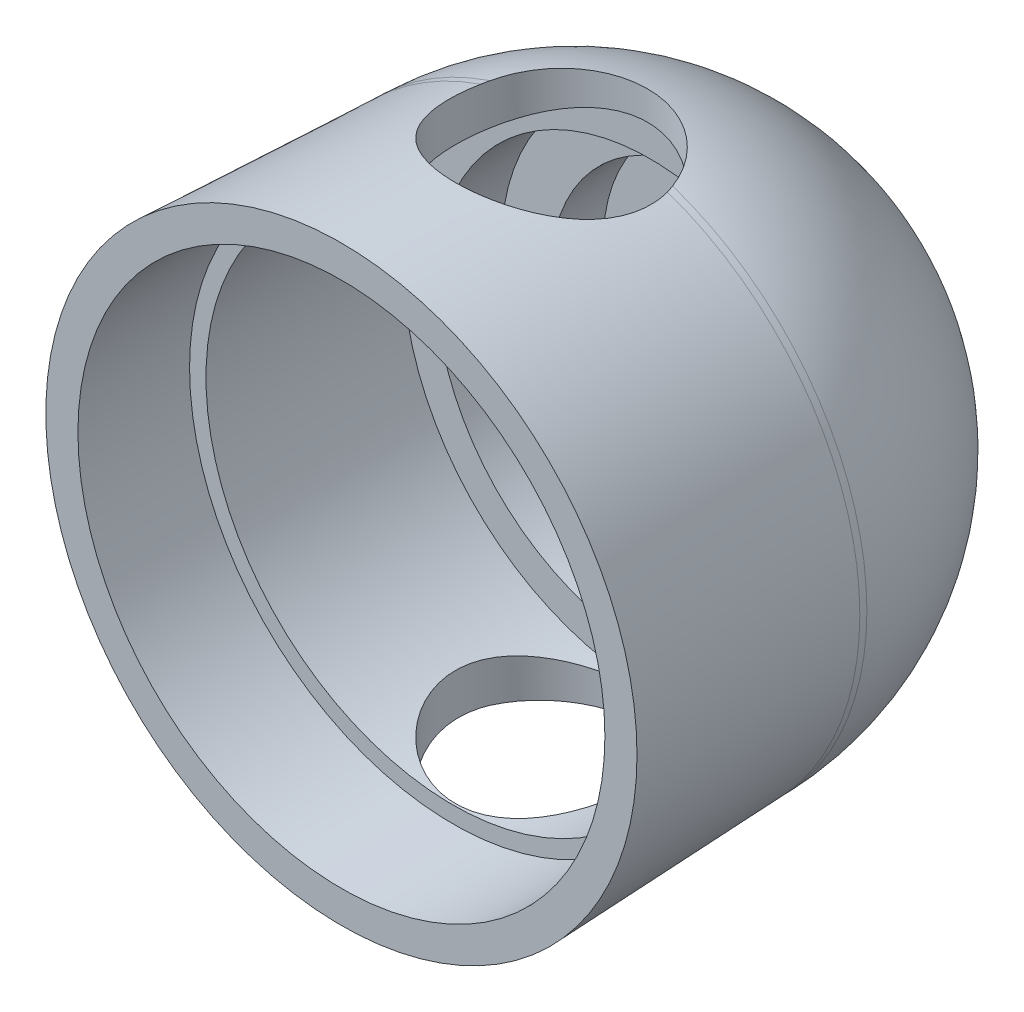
from build123d import *

# Parameters (mm, degrees)
BOSS_EXTRUDE1_REACH     = 117.64
SKETCH33_R              = 40.011320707
SKETCH34_R              = 40.125
CUT_EXTRUDE3_DEPTH      = 17
SKETCH35_R              = 37.625
CUT_EXTRUDE4_DEPTH      = 30
SKETCH36_R              = 32.625
CUT_EXTRUDE5_DEPTH      = 10
SKETCH37_R              = 25.125
CUT_EXTRUDE6_DEPTH      = 8
SKETCH38_R              = 17.625
CUT_EXTRUDE7_DEPTH      = 3
CUT_EXTRUDE8_DEPTH      = 124.631766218
CUT_EXTRUDE8_DEPTH_BACK = 10
SKETCH39_R              = 14.625
CUT_EXTRUDE9_DEPTH      = 10
CUT_EXTRUDE9_DEPTH_BACK = 124.631766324
SKETCH40_R              = 14.625


with BuildPart() as part:
    # Sketch27 → Revolve1 (revolve)
    with BuildSketch(Plane(origin=(5.692383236, 0, 0), x_dir=(0, 0, -1), z_dir=(1, 0, 0)), mode=Mode.PRIVATE) as revolve1_sk:
        with BuildLine():
            Line((35.4435, -66.096753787), (0, -67.605553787))
            Line((0, -67.605553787), (0, -62.601025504))
            Line((0, -62.601025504), (35.26956137, -61.099629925))
            Line((35.26956137, -61.099629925), (36.416384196, -61.068607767))
            ThreePointArc((36.416384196, -61.068607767), (63.002708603, -49.460925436), (73.9347, -22.589704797))
            Line((73.9347, -22.589704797), (78.9347, -22.589704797))
            ThreePointArc((78.9347, -22.589704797), (66.584232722, -52.949863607), (36.54730931, -66.066895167))
            Line((36.54730931, -66.066895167), (35.4435, -66.096753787))
        make_face()
    revolve(revolve1_sk.sketch.rotate(Axis((5.692383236, -22.589704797, 0), (0, 0, -1)), 270), axis=Axis((5.692383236, -22.589704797, 0), (0, 0, -1)))

    # Sketch33 → Boss-Extrude1 (add, up to next)
    with BuildSketch(Plane.XY, mode=Mode.PRIVATE) as boss_extrude1_sk1:
        with Locations((5.692383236, -22.589704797)):
            Circle(SKETCH33_R)
    boss_extrude1_tool1 = extrude(boss_extrude1_sk1.sketch, amount=-BOSS_EXTRUDE1_REACH, mode=Mode.PRIVATE) - part.part
    add(boss_extrude1_tool1.solids().sort_by_distance((5.692383, -22.589705, 0))[0])

    # Sketch34 → Cut-Extrude3 (cut)
    with BuildSketch(Plane.XY):
        with Locations((5.692383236, -22.589704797)):
            Circle(SKETCH34_R)
    extrude(amount=-CUT_EXTRUDE3_DEPTH, mode=Mode.SUBTRACT)

    # Sketch35 → Cut-Extrude4 (cut)
    with BuildSketch(Plane.XY.offset(-17)):
        with Locations((5.692383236, -22.589704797)):
            Circle(SKETCH35_R)
    extrude(amount=-CUT_EXTRUDE4_DEPTH, mode=Mode.SUBTRACT)

    # Sketch36 → Cut-Extrude5 (cut)
    with BuildSketch(Plane.XY.offset(-47)):
        with Locations((5.692383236, -22.589704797)):
            Circle(SKETCH36_R)
    extrude(amount=-CUT_EXTRUDE5_DEPTH, mode=Mode.SUBTRACT)

    # Sketch37 → Cut-Extrude6 (cut)
    with BuildSketch(Plane.XY.offset(-57)):
        with Locations((5.692383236, -22.589704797)):
            Circle(SKETCH37_R)
    extrude(amount=-CUT_EXTRUDE6_DEPTH, mode=Mode.SUBTRACT)

    # Sketch38 → Cut-Extrude7 (cut)
    with BuildSketch(Plane.XY.offset(-65)):
        with Locations((5.692383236, -22.589704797)):
            Circle(SKETCH38_R)
    extrude(amount=-CUT_EXTRUDE7_DEPTH, mode=Mode.SUBTRACT)

    # Sketch39 → Cut-Extrude8 (cut, two sides: drawn at the far end of the back side and taken through both)
    with BuildSketch(Plane(origin=(0, 12.910295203, 0), x_dir=(-1, 0, 0), z_dir=(0, 1, 0)).offset(-CUT_EXTRUDE8_DEPTH_BACK)):
        with Locations(Location((-5.692383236, -32, 0), (0, 0, 90))):
            Circle(SKETCH39_R)
    extrude(amount=CUT_EXTRUDE8_DEPTH + CUT_EXTRUDE8_DEPTH_BACK, mode=Mode.SUBTRACT)

    # Sketch40 → Cut-Extrude9 (cut, two sides: drawn at the far end of the back side and taken through both)
    with BuildSketch(Plane(origin=(0, -58.089704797, 0), x_dir=(-1, 0, 0), z_dir=(0, 1, 0)).offset(-CUT_EXTRUDE9_DEPTH_BACK)):
        with Locations(Location((-5.692383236, -32, 0), (0, 0, 90))):
            Circle(SKETCH40_R)
    extrude(amount=CUT_EXTRUDE9_DEPTH + CUT_EXTRUDE9_DEPTH_BACK, mode=Mode.SUBTRACT)


solid = part.part
